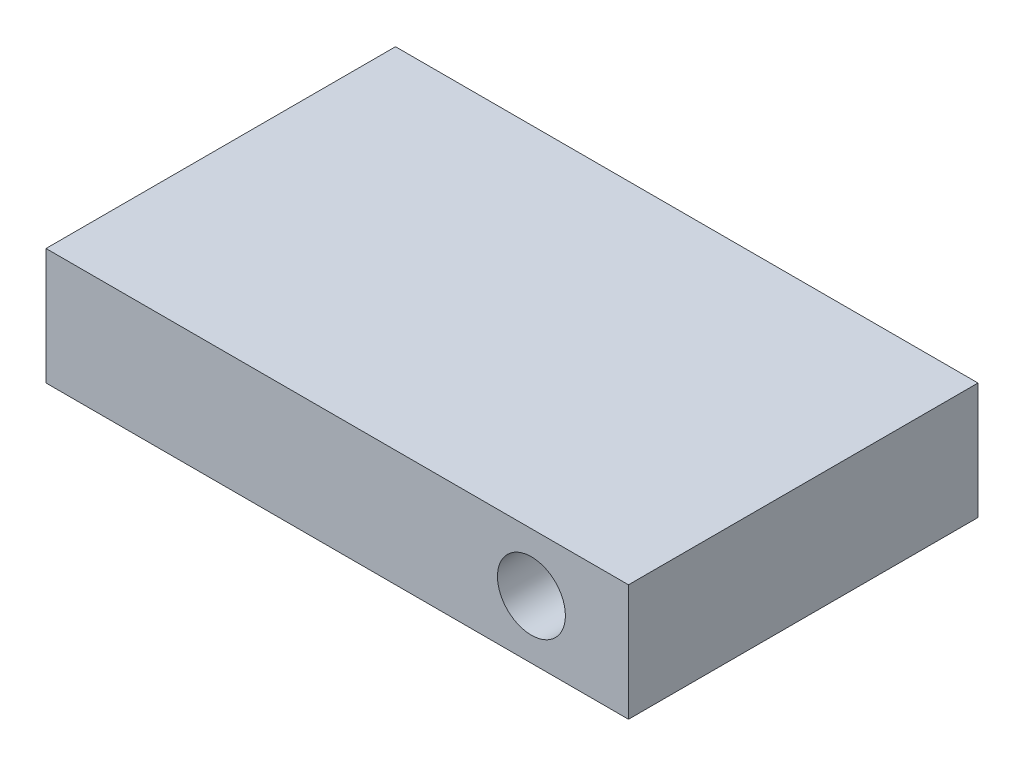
ISO-10303-21;
HEADER;
FILE_DESCRIPTION(('STEP AP214'),'2;1');
FILE_NAME('part.step','',(''),(''),'','','');
FILE_SCHEMA(('AUTOMOTIVE_DESIGN { 1 0 10303 214 1 1 1 1 }'));
ENDSEC;
DATA;
#1=APPLICATION_CONTEXT('core data for automotive mechanical design processes');
#2=APPLICATION_PROTOCOL_DEFINITION('international standard','automotive_design',2000,#1);
#3=PRODUCT_CONTEXT('',#1,'mechanical');
#4=PRODUCT('Part','Part','',(#3));
#5=PRODUCT_RELATED_PRODUCT_CATEGORY('part','',(#4));
#6=PRODUCT_DEFINITION_FORMATION('','',#4);
#7=PRODUCT_DEFINITION_CONTEXT('part definition',#1,'design');
#8=PRODUCT_DEFINITION('design','',#6,#7);
#9=PRODUCT_DEFINITION_SHAPE('','',#8);
#10=(LENGTH_UNIT() NAMED_UNIT(*) SI_UNIT(.MILLI.,.METRE.));
#11=(NAMED_UNIT(*) PLANE_ANGLE_UNIT() SI_UNIT($,.RADIAN.));
#12=(NAMED_UNIT(*) SI_UNIT($,.STERADIAN.) SOLID_ANGLE_UNIT());
#13=UNCERTAINTY_MEASURE_WITH_UNIT(LENGTH_MEASURE(1.E-05),#10,'distance_accuracy_value','');
#14=(GEOMETRIC_REPRESENTATION_CONTEXT(3) GLOBAL_UNCERTAINTY_ASSIGNED_CONTEXT((#13)) GLOBAL_UNIT_ASSIGNED_CONTEXT((#10,
#11,#12)) REPRESENTATION_CONTEXT('',''));
#15=CARTESIAN_POINT('',(0.,0.,0.));
#16=DIRECTION('',(0.,0.,1.));
#17=DIRECTION('',(1.,0.,0.));
#18=AXIS2_PLACEMENT_3D('',#15,#16,#17);
#19=CARTESIAN_POINT('',(0.,6.,0.));
#20=DIRECTION('',(1.,0.,0.));
#21=DIRECTION('',(0.,0.,-1.));
#22=AXIS2_PLACEMENT_3D('',#19,#20,#21);
#23=PLANE('',#22);
#24=DIRECTION('',(0.,0.,1.));
#25=VECTOR('',#24,1.);
#26=CARTESIAN_POINT('',(0.,0.,0.));
#27=LINE('',#26,#25);
#28=CARTESIAN_POINT('',(0.,0.,-18.));
#29=VERTEX_POINT('',#28);
#30=CARTESIAN_POINT('',(0.,0.,0.));
#31=VERTEX_POINT('',#30);
#32=EDGE_CURVE('E74',#29,#31,#27,.T.);
#33=ORIENTED_EDGE('',*,*,#32,.T.);
#34=DIRECTION('',(0.,-1.,0.));
#35=VECTOR('',#34,1.);
#36=CARTESIAN_POINT('',(0.,6.,0.));
#37=LINE('',#36,#35);
#38=CARTESIAN_POINT('',(0.,6.,0.));
#39=VERTEX_POINT('',#38);
#40=EDGE_CURVE('E11',#39,#31,#37,.T.);
#41=ORIENTED_EDGE('',*,*,#40,.F.);
#42=DIRECTION('',(0.,0.,1.));
#43=VECTOR('',#42,1.);
#44=CARTESIAN_POINT('',(0.,6.,0.));
#45=LINE('',#44,#43);
#46=CARTESIAN_POINT('',(0.,6.,-18.));
#47=VERTEX_POINT('',#46);
#48=EDGE_CURVE('E97',#47,#39,#45,.T.);
#49=ORIENTED_EDGE('',*,*,#48,.F.);
#50=DIRECTION('',(0.,-1.,0.));
#51=VECTOR('',#50,1.);
#52=CARTESIAN_POINT('',(0.,6.,-18.));
#53=LINE('',#52,#51);
#54=EDGE_CURVE('E86',#47,#29,#53,.T.);
#55=ORIENTED_EDGE('',*,*,#54,.T.);
#56=EDGE_LOOP('',(#33,#41,#49,#55));
#57=FACE_BOUND('',#56,.T.);
#58=ADVANCED_FACE('F30',(#57),#23,.F.);
#59=CARTESIAN_POINT('',(0.,6.,0.));
#60=DIRECTION('',(0.,0.,-1.));
#61=DIRECTION('',(-1.,0.,0.));
#62=AXIS2_PLACEMENT_3D('',#59,#60,#61);
#63=PLANE('',#62);
#64=CARTESIAN_POINT('',(25.,3.,0.));
#65=DIRECTION('',(0.,0.,1.));
#66=DIRECTION('',(1.,0.,0.));
#67=AXIS2_PLACEMENT_3D('',#64,#65,#66);
#68=CIRCLE('',#67,1.75);
#69=CARTESIAN_POINT('',(26.75,3.,0.));
#70=VERTEX_POINT('',#69);
#71=EDGE_CURVE('E90',#70,#70,#68,.T.);
#72=ORIENTED_EDGE('',*,*,#71,.F.);
#73=EDGE_LOOP('',(#72));
#74=FACE_BOUND('',#73,.T.);
#75=DIRECTION('',(1.,0.,0.));
#76=VECTOR('',#75,1.);
#77=CARTESIAN_POINT('',(0.,0.,0.));
#78=LINE('',#77,#76);
#79=CARTESIAN_POINT('',(30.,0.,0.));
#80=VERTEX_POINT('',#79);
#81=EDGE_CURVE('E70',#31,#80,#78,.T.);
#82=ORIENTED_EDGE('',*,*,#81,.T.);
#83=DIRECTION('',(0.,-1.,0.));
#84=VECTOR('',#83,1.);
#85=CARTESIAN_POINT('',(30.,6.,0.));
#86=LINE('',#85,#84);
#87=CARTESIAN_POINT('',(30.,6.,0.));
#88=VERTEX_POINT('',#87);
#89=EDGE_CURVE('E37',#88,#80,#86,.T.);
#90=ORIENTED_EDGE('',*,*,#89,.F.);
#91=DIRECTION('',(1.,0.,0.));
#92=VECTOR('',#91,1.);
#93=CARTESIAN_POINT('',(0.,6.,0.));
#94=LINE('',#93,#92);
#95=EDGE_CURVE('E82',#39,#88,#94,.T.);
#96=ORIENTED_EDGE('',*,*,#95,.F.);
#97=ORIENTED_EDGE('',*,*,#40,.T.);
#98=EDGE_LOOP('',(#82,#90,#96,#97));
#99=FACE_BOUND('',#98,.T.);
#100=ADVANCED_FACE('F81',(#74,#99),#63,.F.);
#101=CARTESIAN_POINT('',(30.,6.,0.));
#102=DIRECTION('',(-1.,0.,0.));
#103=DIRECTION('',(0.,0.,1.));
#104=AXIS2_PLACEMENT_3D('',#101,#102,#103);
#105=PLANE('',#104);
#106=DIRECTION('',(0.,0.,-1.));
#107=VECTOR('',#106,1.);
#108=CARTESIAN_POINT('',(30.,0.,0.));
#109=LINE('',#108,#107);
#110=CARTESIAN_POINT('',(30.,0.,-18.));
#111=VERTEX_POINT('',#110);
#112=EDGE_CURVE('E75',#80,#111,#109,.T.);
#113=ORIENTED_EDGE('',*,*,#112,.T.);
#114=DIRECTION('',(0.,-1.,0.));
#115=VECTOR('',#114,1.);
#116=CARTESIAN_POINT('',(30.,6.,-18.));
#117=LINE('',#116,#115);
#118=CARTESIAN_POINT('',(30.,6.,-18.));
#119=VERTEX_POINT('',#118);
#120=EDGE_CURVE('E103',#119,#111,#117,.T.);
#121=ORIENTED_EDGE('',*,*,#120,.F.);
#122=DIRECTION('',(0.,0.,-1.));
#123=VECTOR('',#122,1.);
#124=CARTESIAN_POINT('',(30.,6.,0.));
#125=LINE('',#124,#123);
#126=EDGE_CURVE('E49',#88,#119,#125,.T.);
#127=ORIENTED_EDGE('',*,*,#126,.F.);
#128=ORIENTED_EDGE('',*,*,#89,.T.);
#129=EDGE_LOOP('',(#113,#121,#127,#128));
#130=FACE_BOUND('',#129,.T.);
#131=ADVANCED_FACE('F106',(#130),#105,.F.);
#132=CARTESIAN_POINT('',(0.,6.,-18.));
#133=DIRECTION('',(0.,0.,1.));
#134=DIRECTION('',(1.,0.,0.));
#135=AXIS2_PLACEMENT_3D('',#132,#133,#134);
#136=PLANE('',#135);
#137=CARTESIAN_POINT('',(25.,3.,-18.));
#138=DIRECTION('',(0.,0.,1.));
#139=DIRECTION('',(1.,0.,0.));
#140=AXIS2_PLACEMENT_3D('',#137,#138,#139);
#141=CIRCLE('',#140,1.75);
#142=CARTESIAN_POINT('',(26.75,3.,-18.));
#143=VERTEX_POINT('',#142);
#144=EDGE_CURVE('E87',#143,#143,#141,.T.);
#145=ORIENTED_EDGE('',*,*,#144,.T.);
#146=EDGE_LOOP('',(#145));
#147=FACE_BOUND('',#146,.T.);
#148=DIRECTION('',(-1.,0.,0.));
#149=VECTOR('',#148,1.);
#150=CARTESIAN_POINT('',(0.,0.,-18.));
#151=LINE('',#150,#149);
#152=EDGE_CURVE('E95',#111,#29,#151,.T.);
#153=ORIENTED_EDGE('',*,*,#152,.T.);
#154=ORIENTED_EDGE('',*,*,#54,.F.);
#155=DIRECTION('',(-1.,0.,0.));
#156=VECTOR('',#155,1.);
#157=CARTESIAN_POINT('',(0.,6.,-18.));
#158=LINE('',#157,#156);
#159=EDGE_CURVE('E44',#119,#47,#158,.T.);
#160=ORIENTED_EDGE('',*,*,#159,.F.);
#161=ORIENTED_EDGE('',*,*,#120,.T.);
#162=EDGE_LOOP('',(#153,#154,#160,#161));
#163=FACE_BOUND('',#162,.T.);
#164=ADVANCED_FACE('F108',(#147,#163),#136,.F.);
#165=CARTESIAN_POINT('',(0.,6.,-18.));
#166=DIRECTION('',(0.,-1.,0.));
#167=DIRECTION('',(0.,0.,-1.));
#168=AXIS2_PLACEMENT_3D('',#165,#166,#167);
#169=PLANE('',#168);
#170=ORIENTED_EDGE('',*,*,#48,.T.);
#171=ORIENTED_EDGE('',*,*,#95,.T.);
#172=ORIENTED_EDGE('',*,*,#126,.T.);
#173=ORIENTED_EDGE('',*,*,#159,.T.);
#174=EDGE_LOOP('',(#170,#171,#172,#173));
#175=FACE_BOUND('',#174,.T.);
#176=ADVANCED_FACE('F109',(#175),#169,.F.);
#177=CARTESIAN_POINT('',(0.,0.,-18.));
#178=DIRECTION('',(0.,-1.,0.));
#179=DIRECTION('',(0.,0.,-1.));
#180=AXIS2_PLACEMENT_3D('',#177,#178,#179);
#181=PLANE('',#180);
#182=ORIENTED_EDGE('',*,*,#32,.F.);
#183=ORIENTED_EDGE('',*,*,#152,.F.);
#184=ORIENTED_EDGE('',*,*,#112,.F.);
#185=ORIENTED_EDGE('',*,*,#81,.F.);
#186=EDGE_LOOP('',(#182,#183,#184,#185));
#187=FACE_BOUND('',#186,.T.);
#188=ADVANCED_FACE('F71',(#187),#181,.T.);
#189=CARTESIAN_POINT('',(25.,3.,-18.));
#190=DIRECTION('',(0.,0.,1.));
#191=DIRECTION('',(1.,0.,0.));
#192=AXIS2_PLACEMENT_3D('',#189,#190,#191);
#193=CYLINDRICAL_SURFACE('',#192,1.75);
#194=ORIENTED_EDGE('',*,*,#144,.F.);
#195=EDGE_LOOP('',(#194));
#196=FACE_BOUND('',#195,.T.);
#197=ORIENTED_EDGE('',*,*,#71,.T.);
#198=EDGE_LOOP('',(#197));
#199=FACE_BOUND('',#198,.T.);
#200=ADVANCED_FACE('F116',(#196,#199),#193,.F.);
#201=CLOSED_SHELL('',(#58,#100,#131,#164,#176,#188,#200));
#202=MANIFOLD_SOLID_BREP('B2',#201);
#203=ADVANCED_BREP_SHAPE_REPRESENTATION('',(#18,#202),#14);
#204=SHAPE_DEFINITION_REPRESENTATION(#9,#203);
ENDSEC;
END-ISO-10303-21;
